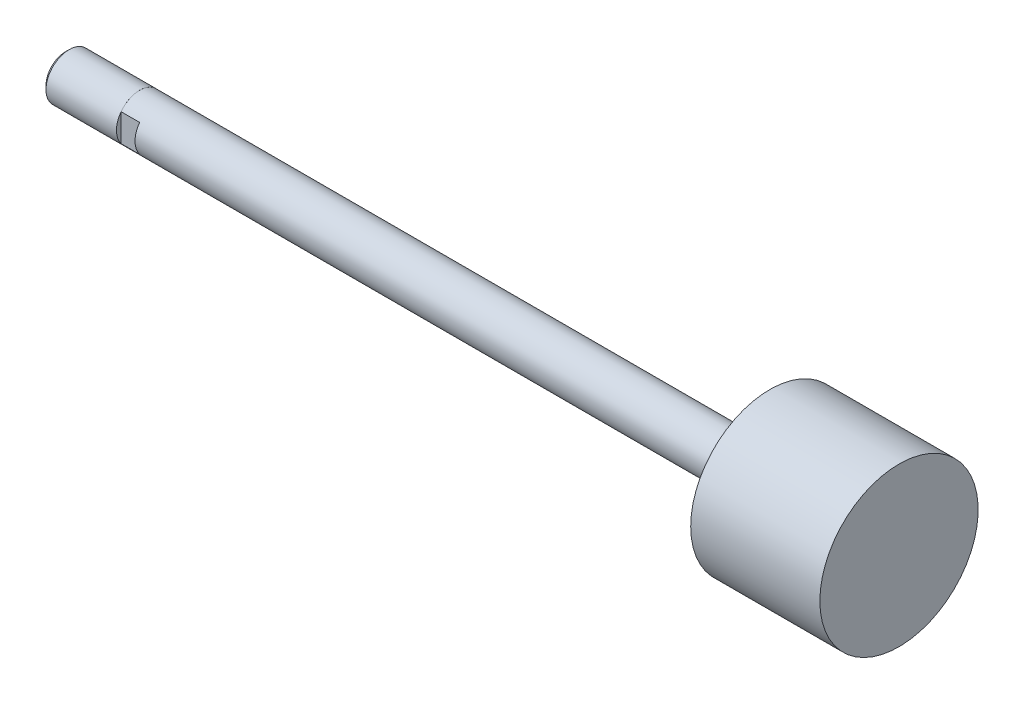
ISO-10303-21;
HEADER;
FILE_DESCRIPTION(('STEP AP214'),'2;1');
FILE_NAME('part.step','',(''),(''),'','','');
FILE_SCHEMA(('AUTOMOTIVE_DESIGN { 1 0 10303 214 1 1 1 1 }'));
ENDSEC;
DATA;
#1=APPLICATION_CONTEXT('core data for automotive mechanical design processes');
#2=APPLICATION_PROTOCOL_DEFINITION('international standard','automotive_design',2000,#1);
#3=PRODUCT_CONTEXT('',#1,'mechanical');
#4=PRODUCT('Part','Part','',(#3));
#5=PRODUCT_RELATED_PRODUCT_CATEGORY('part','',(#4));
#6=PRODUCT_DEFINITION_FORMATION('','',#4);
#7=PRODUCT_DEFINITION_CONTEXT('part definition',#1,'design');
#8=PRODUCT_DEFINITION('design','',#6,#7);
#9=PRODUCT_DEFINITION_SHAPE('','',#8);
#10=(LENGTH_UNIT() NAMED_UNIT(*) SI_UNIT(.MILLI.,.METRE.));
#11=(NAMED_UNIT(*) PLANE_ANGLE_UNIT() SI_UNIT($,.RADIAN.));
#12=(NAMED_UNIT(*) SI_UNIT($,.STERADIAN.) SOLID_ANGLE_UNIT());
#13=UNCERTAINTY_MEASURE_WITH_UNIT(LENGTH_MEASURE(1.E-05),#10,'distance_accuracy_value','');
#14=(GEOMETRIC_REPRESENTATION_CONTEXT(3) GLOBAL_UNCERTAINTY_ASSIGNED_CONTEXT((#13)) GLOBAL_UNIT_ASSIGNED_CONTEXT((#10,
#11,#12)) REPRESENTATION_CONTEXT('',''));
#15=CARTESIAN_POINT('',(0.,0.,0.));
#16=DIRECTION('',(0.,0.,1.));
#17=DIRECTION('',(1.,0.,0.));
#18=AXIS2_PLACEMENT_3D('',#15,#16,#17);
#19=CARTESIAN_POINT('',(-15.875,0.,0.));
#20=DIRECTION('',(1.,0.,0.));
#21=DIRECTION('',(0.,0.,-1.));
#22=AXIS2_PLACEMENT_3D('',#19,#20,#21);
#23=PLANE('',#22);
#24=CARTESIAN_POINT('',(-15.8749999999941,0.,0.));
#25=DIRECTION('',(1.,0.,0.));
#26=DIRECTION('',(0.,1.,0.));
#27=AXIS2_PLACEMENT_3D('',#24,#25,#26);
#28=CIRCLE('',#27,3.33883000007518);
#29=CARTESIAN_POINT('',(-15.8749999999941,3.33883000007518,0.));
#30=VERTEX_POINT('',#29);
#31=EDGE_CURVE('E20',#30,#30,#28,.T.);
#32=ORIENTED_EDGE('',*,*,#31,.F.);
#33=EDGE_LOOP('',(#32));
#34=FACE_BOUND('',#33,.T.);
#35=ADVANCED_FACE('F17',(#34),#23,.F.);
#36=CARTESIAN_POINT('',(126.8984,13.55725,0.));
#37=DIRECTION('',(-1.,0.,0.));
#38=DIRECTION('',(0.,0.,1.));
#39=AXIS2_PLACEMENT_3D('',#36,#37,#38);
#40=PLANE('',#39);
#41=CARTESIAN_POINT('',(126.8984,0.,0.));
#42=DIRECTION('',(-1.,0.,0.));
#43=DIRECTION('',(0.,0.,1.));
#44=AXIS2_PLACEMENT_3D('',#41,#42,#43);
#45=CIRCLE('',#44,13.55725);
#46=CARTESIAN_POINT('',(126.8984,0.,13.55725));
#47=VERTEX_POINT('',#46);
#48=EDGE_CURVE('E92',#47,#47,#45,.T.);
#49=ORIENTED_EDGE('',*,*,#48,.F.);
#50=EDGE_LOOP('',(#49));
#51=FACE_BOUND('',#50,.T.);
#52=ADVANCED_FACE('F105',(#51),#40,.F.);
#53=CARTESIAN_POINT('',(-15.2450799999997,0.,0.));
#54=DIRECTION('',(1.,0.,0.));
#55=DIRECTION('',(0.,1.,0.));
#56=AXIS2_PLACEMENT_3D('',#53,#54,#55);
#57=CONICAL_SURFACE('',#56,3.96875000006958,0.785398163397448);
#58=ORIENTED_EDGE('',*,*,#31,.T.);
#59=EDGE_LOOP('',(#58));
#60=FACE_BOUND('',#59,.T.);
#61=CARTESIAN_POINT('',(-15.24508,0.,0.));
#62=DIRECTION('',(-1.,0.,0.));
#63=DIRECTION('',(0.,0.,1.));
#64=AXIS2_PLACEMENT_3D('',#61,#62,#63);
#65=CIRCLE('',#64,3.96875);
#66=CARTESIAN_POINT('',(-15.24508,0.,3.96875));
#67=VERTEX_POINT('',#66);
#68=EDGE_CURVE('E91',#67,#67,#65,.F.);
#69=ORIENTED_EDGE('',*,*,#68,.F.);
#70=EDGE_LOOP('',(#69));
#71=FACE_BOUND('',#70,.T.);
#72=ADVANCED_FACE('F101',(#60,#71),#57,.T.);
#73=CARTESIAN_POINT('',(126.8984,0.,0.));
#74=DIRECTION('',(-1.,0.,0.));
#75=DIRECTION('',(0.,0.,1.));
#76=AXIS2_PLACEMENT_3D('',#73,#74,#75);
#77=CYLINDRICAL_SURFACE('',#76,13.55725);
#78=CARTESIAN_POINT('',(104.775,0.,0.));
#79=DIRECTION('',(-1.,0.,0.));
#80=DIRECTION('',(0.,0.,1.));
#81=AXIS2_PLACEMENT_3D('',#78,#79,#80);
#82=CIRCLE('',#81,13.55725);
#83=CARTESIAN_POINT('',(104.775,0.,13.55725));
#84=VERTEX_POINT('',#83);
#85=EDGE_CURVE('E89',#84,#84,#82,.F.);
#86=ORIENTED_EDGE('',*,*,#85,.T.);
#87=EDGE_LOOP('',(#86));
#88=FACE_BOUND('',#87,.T.);
#89=ORIENTED_EDGE('',*,*,#48,.T.);
#90=EDGE_LOOP('',(#89));
#91=FACE_BOUND('',#90,.T.);
#92=ADVANCED_FACE('F139',(#88,#91),#77,.T.);
#93=CARTESIAN_POINT('',(-3.175,0.,0.));
#94=DIRECTION('',(-1.,0.,0.));
#95=DIRECTION('',(0.,0.,1.));
#96=AXIS2_PLACEMENT_3D('',#93,#94,#95);
#97=CYLINDRICAL_SURFACE('',#96,3.96875);
#98=ORIENTED_EDGE('',*,*,#68,.T.);
#99=EDGE_LOOP('',(#98));
#100=FACE_BOUND('',#99,.T.);
#101=CARTESIAN_POINT('',(-3.175,0.,0.));
#102=DIRECTION('',(-1.,0.,0.));
#103=DIRECTION('',(0.,0.,1.));
#104=AXIS2_PLACEMENT_3D('',#101,#102,#103);
#105=CIRCLE('',#104,3.96875);
#106=CARTESIAN_POINT('',(-3.175,0.,3.96875));
#107=VERTEX_POINT('',#106);
#108=EDGE_CURVE('E65',#107,#107,#105,.T.);
#109=ORIENTED_EDGE('',*,*,#108,.T.);
#110=EDGE_LOOP('',(#109));
#111=FACE_BOUND('',#110,.T.);
#112=ADVANCED_FACE('F135',(#100,#111),#97,.T.);
#113=CARTESIAN_POINT('',(104.775,3.9624,0.));
#114=DIRECTION('',(1.,0.,0.));
#115=DIRECTION('',(0.,0.,-1.));
#116=AXIS2_PLACEMENT_3D('',#113,#114,#115);
#117=PLANE('',#116);
#118=CARTESIAN_POINT('',(104.775,0.,0.));
#119=DIRECTION('',(-1.,0.,0.));
#120=DIRECTION('',(0.,0.,1.));
#121=AXIS2_PLACEMENT_3D('',#118,#119,#120);
#122=CIRCLE('',#121,3.9624);
#123=CARTESIAN_POINT('',(104.775,0.,3.9624));
#124=VERTEX_POINT('',#123);
#125=EDGE_CURVE('E79',#124,#124,#122,.T.);
#126=ORIENTED_EDGE('',*,*,#125,.F.);
#127=EDGE_LOOP('',(#126));
#128=FACE_BOUND('',#127,.T.);
#129=ORIENTED_EDGE('',*,*,#85,.F.);
#130=EDGE_LOOP('',(#129));
#131=FACE_BOUND('',#130,.T.);
#132=ADVANCED_FACE('F131',(#128,#131),#117,.F.);
#133=CARTESIAN_POINT('',(0.,0.,0.));
#134=DIRECTION('',(1.,0.,0.));
#135=DIRECTION('',(0.,0.,-1.));
#136=AXIS2_PLACEMENT_3D('',#133,#134,#135);
#137=PLANE('',#136);
#138=CARTESIAN_POINT('',(0.,0.,0.));
#139=DIRECTION('',(-1.,0.,0.));
#140=DIRECTION('',(0.,0.,1.));
#141=AXIS2_PLACEMENT_3D('',#138,#139,#140);
#142=CIRCLE('',#141,3.9624);
#143=CARTESIAN_POINT('',(0.,2.37065154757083,3.175));
#144=VERTEX_POINT('',#143);
#145=CARTESIAN_POINT('',(0.,-2.37065154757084,3.175));
#146=VERTEX_POINT('',#145);
#147=EDGE_CURVE('E74',#144,#146,#142,.F.);
#148=ORIENTED_EDGE('',*,*,#147,.F.);
#149=DIRECTION('',(0.,1.,0.));
#150=VECTOR('',#149,1.);
#151=CARTESIAN_POINT('',(0.,3.9624,3.175));
#152=LINE('',#151,#150);
#153=EDGE_CURVE('E66',#144,#146,#152,.F.);
#154=ORIENTED_EDGE('',*,*,#153,.T.);
#155=EDGE_LOOP('',(#148,#154));
#156=FACE_BOUND('',#155,.T.);
#157=ADVANCED_FACE('F128',(#156),#137,.F.);
#158=CARTESIAN_POINT('',(0.,3.9624,3.175));
#159=DIRECTION('',(0.,0.,-1.));
#160=DIRECTION('',(-1.,0.,0.));
#161=AXIS2_PLACEMENT_3D('',#158,#159,#160);
#162=PLANE('',#161);
#163=DIRECTION('',(-1.,0.,0.));
#164=VECTOR('',#163,1.);
#165=CARTESIAN_POINT('',(126.8984,-2.37065154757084,3.175));
#166=LINE('',#165,#164);
#167=CARTESIAN_POINT('',(-3.17500000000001,-2.37065154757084,3.175));
#168=VERTEX_POINT('',#167);
#169=EDGE_CURVE('E252',#146,#168,#166,.T.);
#170=ORIENTED_EDGE('',*,*,#169,.F.);
#171=ORIENTED_EDGE('',*,*,#153,.F.);
#172=DIRECTION('',(-1.,0.,0.));
#173=VECTOR('',#172,1.);
#174=CARTESIAN_POINT('',(126.8984,2.37065154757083,3.175));
#175=LINE('',#174,#173);
#176=CARTESIAN_POINT('',(-3.17500000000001,2.37065154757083,3.175));
#177=VERTEX_POINT('',#176);
#178=EDGE_CURVE('E69',#177,#144,#175,.F.);
#179=ORIENTED_EDGE('',*,*,#178,.F.);
#180=DIRECTION('',(0.,1.,0.));
#181=VECTOR('',#180,1.);
#182=CARTESIAN_POINT('',(-3.175,3.96875,3.175));
#183=LINE('',#182,#181);
#184=EDGE_CURVE('E57',#177,#168,#183,.F.);
#185=ORIENTED_EDGE('',*,*,#184,.T.);
#186=EDGE_LOOP('',(#170,#171,#179,#185));
#187=FACE_BOUND('',#186,.T.);
#188=ADVANCED_FACE('F70',(#187),#162,.F.);
#189=CARTESIAN_POINT('',(-3.175,3.96875,0.));
#190=DIRECTION('',(-1.,0.,0.));
#191=DIRECTION('',(0.,0.,1.));
#192=AXIS2_PLACEMENT_3D('',#189,#190,#191);
#193=PLANE('',#192);
#194=ORIENTED_EDGE('',*,*,#108,.F.);
#195=EDGE_LOOP('',(#194));
#196=FACE_BOUND('',#195,.T.);
#197=DIRECTION('',(0.,1.,0.));
#198=VECTOR('',#197,1.);
#199=CARTESIAN_POINT('',(-3.175,-3.9624,-3.175));
#200=LINE('',#199,#198);
#201=CARTESIAN_POINT('',(-3.17500000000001,2.37065154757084,-3.175));
#202=VERTEX_POINT('',#201);
#203=CARTESIAN_POINT('',(-3.17500000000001,-2.37065154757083,-3.175));
#204=VERTEX_POINT('',#203);
#205=EDGE_CURVE('E82',#202,#204,#200,.F.);
#206=ORIENTED_EDGE('',*,*,#205,.T.);
#207=CARTESIAN_POINT('',(-3.17500000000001,0.,0.));
#208=DIRECTION('',(-1.,0.,0.));
#209=DIRECTION('',(0.,0.,1.));
#210=AXIS2_PLACEMENT_3D('',#207,#208,#209);
#211=CIRCLE('',#210,3.9624);
#212=EDGE_CURVE('E61',#168,#204,#211,.F.);
#213=ORIENTED_EDGE('',*,*,#212,.F.);
#214=ORIENTED_EDGE('',*,*,#184,.F.);
#215=CARTESIAN_POINT('',(-3.17500000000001,0.,0.));
#216=DIRECTION('',(-1.,0.,0.));
#217=DIRECTION('',(0.,0.,1.));
#218=AXIS2_PLACEMENT_3D('',#215,#216,#217);
#219=CIRCLE('',#218,3.9624);
#220=EDGE_CURVE('E54',#202,#177,#219,.F.);
#221=ORIENTED_EDGE('',*,*,#220,.F.);
#222=EDGE_LOOP('',(#206,#213,#214,#221));
#223=FACE_BOUND('',#222,.T.);
#224=ADVANCED_FACE('F59',(#196,#223),#193,.F.);
#225=CARTESIAN_POINT('',(0.,0.,0.));
#226=DIRECTION('',(1.,0.,0.));
#227=DIRECTION('',(0.,0.,-1.));
#228=AXIS2_PLACEMENT_3D('',#225,#226,#227);
#229=PLANE('',#228);
#230=CARTESIAN_POINT('',(0.,0.,0.));
#231=DIRECTION('',(-1.,0.,0.));
#232=DIRECTION('',(0.,0.,1.));
#233=AXIS2_PLACEMENT_3D('',#230,#231,#232);
#234=CIRCLE('',#233,3.9624);
#235=CARTESIAN_POINT('',(0.,-2.37065154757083,-3.175));
#236=VERTEX_POINT('',#235);
#237=CARTESIAN_POINT('',(0.,2.37065154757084,-3.175));
#238=VERTEX_POINT('',#237);
#239=EDGE_CURVE('E26',#236,#238,#234,.F.);
#240=ORIENTED_EDGE('',*,*,#239,.F.);
#241=DIRECTION('',(0.,1.,0.));
#242=VECTOR('',#241,1.);
#243=CARTESIAN_POINT('',(0.,-3.9624,-3.175));
#244=LINE('',#243,#242);
#245=EDGE_CURVE('E34',#236,#238,#244,.T.);
#246=ORIENTED_EDGE('',*,*,#245,.T.);
#247=EDGE_LOOP('',(#240,#246));
#248=FACE_BOUND('',#247,.T.);
#249=ADVANCED_FACE('F117',(#248),#229,.F.);
#250=CARTESIAN_POINT('',(0.,-3.9624,-3.175));
#251=DIRECTION('',(0.,0.,1.));
#252=DIRECTION('',(1.,0.,0.));
#253=AXIS2_PLACEMENT_3D('',#250,#251,#252);
#254=PLANE('',#253);
#255=DIRECTION('',(-1.,0.,0.));
#256=VECTOR('',#255,1.);
#257=CARTESIAN_POINT('',(126.8984,2.37065154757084,-3.175));
#258=LINE('',#257,#256);
#259=EDGE_CURVE('E11',#238,#202,#258,.T.);
#260=ORIENTED_EDGE('',*,*,#259,.F.);
#261=ORIENTED_EDGE('',*,*,#245,.F.);
#262=DIRECTION('',(-1.,0.,0.));
#263=VECTOR('',#262,1.);
#264=CARTESIAN_POINT('',(126.8984,-2.37065154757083,-3.175));
#265=LINE('',#264,#263);
#266=EDGE_CURVE('E254',#204,#236,#265,.F.);
#267=ORIENTED_EDGE('',*,*,#266,.F.);
#268=ORIENTED_EDGE('',*,*,#205,.F.);
#269=EDGE_LOOP('',(#260,#261,#267,#268));
#270=FACE_BOUND('',#269,.T.);
#271=ADVANCED_FACE('F112',(#270),#254,.F.);
#272=CARTESIAN_POINT('',(126.8984,0.,0.));
#273=DIRECTION('',(-1.,0.,0.));
#274=DIRECTION('',(0.,0.,1.));
#275=AXIS2_PLACEMENT_3D('',#272,#273,#274);
#276=CYLINDRICAL_SURFACE('',#275,3.9624);
#277=ORIENTED_EDGE('',*,*,#239,.T.);
#278=ORIENTED_EDGE('',*,*,#259,.T.);
#279=ORIENTED_EDGE('',*,*,#220,.T.);
#280=ORIENTED_EDGE('',*,*,#178,.T.);
#281=ORIENTED_EDGE('',*,*,#147,.T.);
#282=ORIENTED_EDGE('',*,*,#169,.T.);
#283=ORIENTED_EDGE('',*,*,#212,.T.);
#284=ORIENTED_EDGE('',*,*,#266,.T.);
#285=EDGE_LOOP('',(#277,#278,#279,#280,#281,#282,#283,#284));
#286=FACE_BOUND('',#285,.T.);
#287=ORIENTED_EDGE('',*,*,#125,.T.);
#288=EDGE_LOOP('',(#287));
#289=FACE_BOUND('',#288,.T.);
#290=ADVANCED_FACE('F77',(#286,#289),#276,.T.);
#291=CLOSED_SHELL('',(#35,#52,#72,#92,#112,#132,#157,#188,#224,#249,#271,#290));
#292=MANIFOLD_SOLID_BREP('B1',#291);
#293=ADVANCED_BREP_SHAPE_REPRESENTATION('',(#18,#292),#14);
#294=SHAPE_DEFINITION_REPRESENTATION(#9,#293);
ENDSEC;
END-ISO-10303-21;
